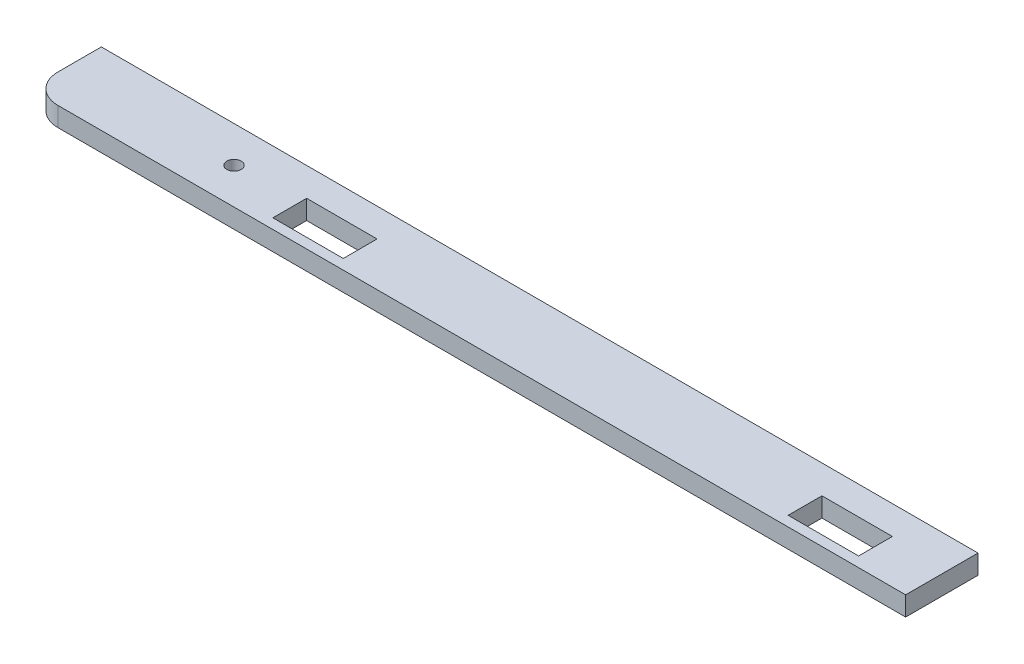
from build123d import *

# Parameters (mm, degrees)
SKETCH1_W           = 181.7
SKETCH1_H           = 15
SKETCH1_R           = 1.5
BOSS_EXTRUDE1_DEPTH = 4
SKETCH4_W           = 14.6
SKETCH4_H           = 7
CUT_EXTRUDE3_DEPTH  = 161.814248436
SKETCH5_W           = 14.6
SKETCH5_H           = 7
CUT_EXTRUDE4_DEPTH  = 161.814248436
FILLET1_R           = 6


with BuildPart() as part:
    # Sketch1 → Boss-Extrude1 (new body)
    with BuildSketch(Plane(origin=(0, 3, 0), x_dir=(1, 0, 0), z_dir=(0, 1, 0))):
        with Locations((-15, -113.5)):
            Rectangle(SKETCH1_W, SKETCH1_H)
        with Locations(Location((-70.85, -113.5, 0), (0, 0, 270))):
            Circle(SKETCH1_R, mode=Mode.SUBTRACT)
    extrude(amount=-BOSS_EXTRUDE1_DEPTH)

    # Sketch4 → Cut-Extrude3 (cut, through all)
    with BuildSketch(Plane(origin=(0, 3, 0), x_dir=(-1, 0, 0), z_dir=(0, 1, 0))):
        with Locations((-56.7, 115.4)):
            Rectangle(SKETCH4_W, SKETCH4_H)
        with BuildLine():
            Line((-57.401923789, 113.9), (-53.4, 113.9))
            ThreePointArc((-53.4, 113.9), (-51.9, 115.4), (-53.4, 116.9))
            Line((-53.4, 116.9), (-57.401923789, 116.9))
            ThreePointArc((-57.401923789, 116.9), (-57, 115.4), (-57.401923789, 113.9))
        make_face(mode=Mode.SUBTRACT)
    extrude(amount=-CUT_EXTRUDE3_DEPTH, mode=Mode.SUBTRACT)


with BuildPart() as body_2:
    # of the pieces the cut leaves, the one that is kept (cut_extrude3_keep)
    add(part.part.solids().sort_by_distance((-105.85, 3, 121))[0])

    # Sketch5 → Cut-Extrude4 (cut, through all)
    with BuildSketch(Plane.XZ.offset(1)):
        with Locations((-50.1, 115.4)):
            Rectangle(SKETCH5_W, SKETCH5_H)
        with BuildLine():
            Line((-53.4, 113.9), (-49.398076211, 113.9))
            ThreePointArc((-49.398076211, 113.9), (-49.8, 115.4), (-49.398076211, 116.9))
            Line((-49.398076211, 116.9), (-53.4, 116.9))
            ThreePointArc((-53.4, 116.9), (-54.9, 115.4), (-53.4, 113.9))
        make_face(mode=Mode.SUBTRACT)
    extrude(amount=-CUT_EXTRUDE4_DEPTH, mode=Mode.SUBTRACT)


with BuildPart() as body_2_2:
    # of the pieces the cut leaves, the one that is kept (cut_extrude4_keep)
    add(body_2.part.solids().sort_by_distance((-105.85, 3, 121))[0])

    # Fillet1
    fillet1_edges = [body_2_2.edges().sort_by_distance(p)[0] for p in [
        (-105.85, 1, 121),
    ]]
    fillet(fillet1_edges, radius=FILLET1_R)


solid = body_2_2.part
